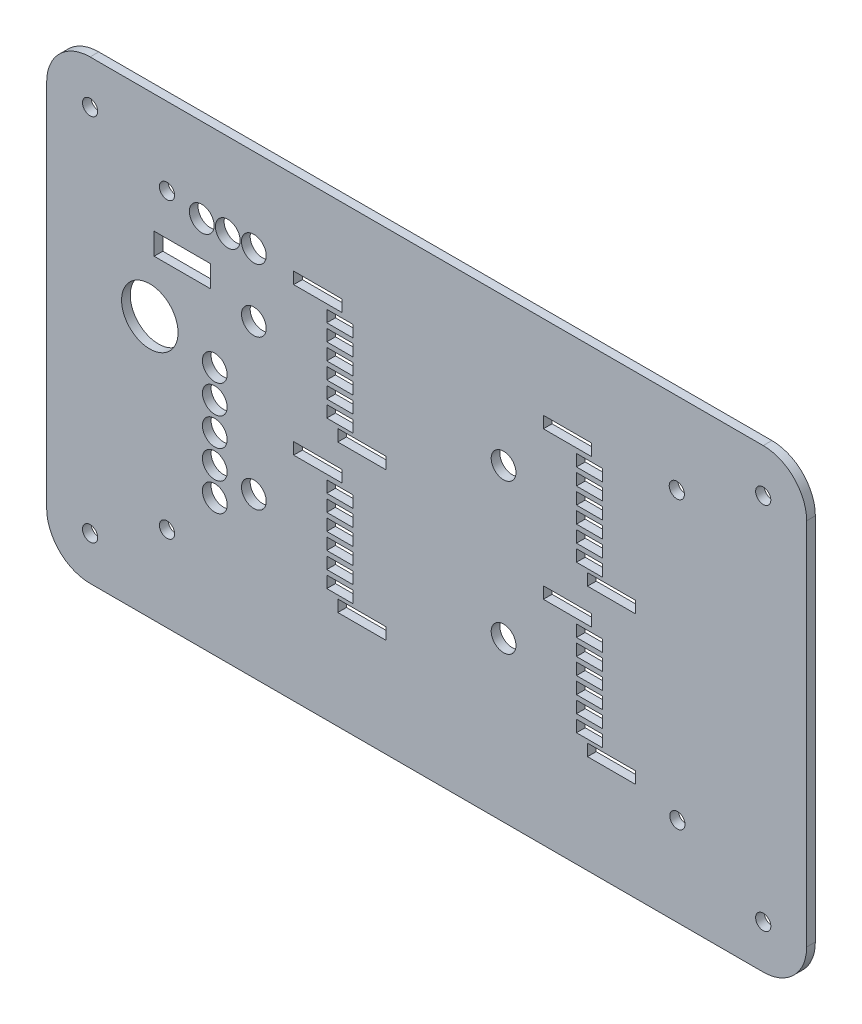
from build123d import *

# Parameters (mm, degrees)
ESQUISSE1_R      = 2.85
ESQUISSE1_R_2    = 6.5
ESQUISSE1_R_3    = 1.75
ESQUISSE1_W      = 11.08
ESQUISSE1_H      = 2.7
ESQUISSE1_W_2    = 6
ESQUISSE1_W_3    = 13
ESQUISSE1_H_2    = 5
EXTRUSION1_DEPTH = 2


with BuildPart() as part:
    # Esquisse1 → Extrusion1 (new body)
    with BuildSketch(Plane.XY):
        with BuildLine():
            Line((-78.68, 51.42), (76.32, 51.42))
            ThreePointArc((76.32, 51.42), (83.391067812, 48.491067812), (86.32, 41.42))
            Line((86.32, 41.42), (86.32, -43.58))
            ThreePointArc((86.32, -43.58), (83.391067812, -50.651067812), (76.32, -53.58))
            Line((76.32, -53.58), (-78.68, -53.58))
            ThreePointArc((-78.68, -53.58), (-85.751067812, -50.651067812), (-88.68, -43.58))
            Line((-88.68, -43.58), (-88.68, 41.42))
            ThreePointArc((-88.68, 41.42), (-85.751067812, 48.491067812), (-78.68, 51.42))
        make_face()
        with Locations((16.53, 17.55)):
            Circle(ESQUISSE1_R, mode=Mode.SUBTRACT)
        with Locations((-40.97, 17.55)):
            Circle(ESQUISSE1_R, mode=Mode.SUBTRACT)
        with Locations((16.53, -16.9299)):
            Circle(ESQUISSE1_R, mode=Mode.SUBTRACT)
        with Locations((-40.97, -16.9299)):
            Circle(ESQUISSE1_R, mode=Mode.SUBTRACT)
        with Locations((-52.97, 32.05)):
            Circle(ESQUISSE1_R, mode=Mode.SUBTRACT)
        with Locations((-46.97, 32.05)):
            Circle(ESQUISSE1_R, mode=Mode.SUBTRACT)
        with Locations((-40.97, 32.05)):
            Circle(ESQUISSE1_R, mode=Mode.SUBTRACT)
        with Locations((-49.97, 3.8401)):
            Circle(ESQUISSE1_R, mode=Mode.SUBTRACT)
        with Locations((-49.97, -2.6599)):
            Circle(ESQUISSE1_R, mode=Mode.SUBTRACT)
        with Locations((-49.97, -9.1599)):
            Circle(ESQUISSE1_R, mode=Mode.SUBTRACT)
        with Locations((-49.97, -15.6599)):
            Circle(ESQUISSE1_R, mode=Mode.SUBTRACT)
        with Locations((-49.97, -22.1599)):
            Circle(ESQUISSE1_R, mode=Mode.SUBTRACT)
        with Locations((-64.93, 6.55)):
            Circle(ESQUISSE1_R_2, mode=Mode.SUBTRACT)
        with Locations((-60.97, 33.55)):
            Circle(ESQUISSE1_R_3, mode=Mode.SUBTRACT)
        with Locations((-60.97, -33.98)):
            Circle(ESQUISSE1_R_3, mode=Mode.SUBTRACT)
        with Locations((56.56, -33.17)):
            Circle(ESQUISSE1_R_3, mode=Mode.SUBTRACT)
        with Locations((56.42, 32.6)):
            Circle(ESQUISSE1_R_3, mode=Mode.SUBTRACT)
        with Locations((76.32, 41.42)):
            Circle(ESQUISSE1_R_3, mode=Mode.SUBTRACT)
        with Locations((-78.68, 41.42)):
            Circle(ESQUISSE1_R_3, mode=Mode.SUBTRACT)
        with Locations((-78.68, -43.58)):
            Circle(ESQUISSE1_R_3, mode=Mode.SUBTRACT)
        with Locations((76.32, -43.58)):
            Circle(ESQUISSE1_R_3, mode=Mode.SUBTRACT)
        with Locations((-16.1, 4.5)):
            Rectangle(ESQUISSE1_W, ESQUISSE1_H, mode=Mode.SUBTRACT)
        with Locations((-26.26, 30.8)):
            Rectangle(ESQUISSE1_W, ESQUISSE1_H, mode=Mode.SUBTRACT)
        with Locations((41.4, -29.5)):
            Rectangle(ESQUISSE1_W, ESQUISSE1_H, mode=Mode.SUBTRACT)
        with Locations((41.4, 4.5)):
            Rectangle(ESQUISSE1_W, ESQUISSE1_H, mode=Mode.SUBTRACT)
        with Locations((-21.18, 8)):
            Rectangle(ESQUISSE1_W_2, ESQUISSE1_H, mode=Mode.SUBTRACT)
        with Locations((-21.18, 11.8)):
            Rectangle(ESQUISSE1_W_2, ESQUISSE1_H, mode=Mode.SUBTRACT)
        with Locations((-21.18, 15.6)):
            Rectangle(ESQUISSE1_W_2, ESQUISSE1_H, mode=Mode.SUBTRACT)
        with Locations((-21.18, 19.4)):
            Rectangle(ESQUISSE1_W_2, ESQUISSE1_H, mode=Mode.SUBTRACT)
        with Locations((-21.18, 23.2)):
            Rectangle(ESQUISSE1_W_2, ESQUISSE1_H, mode=Mode.SUBTRACT)
        with Locations((-21.18, 27)):
            Rectangle(ESQUISSE1_W_2, ESQUISSE1_H, mode=Mode.SUBTRACT)
        with Locations((36.32, 8)):
            Rectangle(ESQUISSE1_W_2, ESQUISSE1_H, mode=Mode.SUBTRACT)
        with Locations((36.32, 11.8)):
            Rectangle(ESQUISSE1_W_2, ESQUISSE1_H, mode=Mode.SUBTRACT)
        with Locations((36.32, 15.6)):
            Rectangle(ESQUISSE1_W_2, ESQUISSE1_H, mode=Mode.SUBTRACT)
        with Locations((36.32, 19.4)):
            Rectangle(ESQUISSE1_W_2, ESQUISSE1_H, mode=Mode.SUBTRACT)
        with Locations((36.32, 23.2)):
            Rectangle(ESQUISSE1_W_2, ESQUISSE1_H, mode=Mode.SUBTRACT)
        with Locations((36.32, 27)):
            Rectangle(ESQUISSE1_W_2, ESQUISSE1_H, mode=Mode.SUBTRACT)
        with Locations((31.24, 30.8)):
            Rectangle(ESQUISSE1_W, ESQUISSE1_H, mode=Mode.SUBTRACT)
        with Locations((-57.43, 21.55)):
            Rectangle(ESQUISSE1_W_3, ESQUISSE1_H_2, mode=Mode.SUBTRACT)
        with Locations((-16.1, -29.5)):
            Rectangle(ESQUISSE1_W, ESQUISSE1_H, mode=Mode.SUBTRACT)
        with Locations((-21.18, -26)):
            Rectangle(ESQUISSE1_W_2, ESQUISSE1_H, mode=Mode.SUBTRACT)
        with Locations((-21.18, -22.2)):
            Rectangle(ESQUISSE1_W_2, ESQUISSE1_H, mode=Mode.SUBTRACT)
        with Locations((-21.18, -18.4)):
            Rectangle(ESQUISSE1_W_2, ESQUISSE1_H, mode=Mode.SUBTRACT)
        with Locations((-21.18, -14.6)):
            Rectangle(ESQUISSE1_W_2, ESQUISSE1_H, mode=Mode.SUBTRACT)
        with Locations((-21.18, -10.8)):
            Rectangle(ESQUISSE1_W_2, ESQUISSE1_H, mode=Mode.SUBTRACT)
        with Locations((-21.18, -7)):
            Rectangle(ESQUISSE1_W_2, ESQUISSE1_H, mode=Mode.SUBTRACT)
        with Locations((36.32, -26)):
            Rectangle(ESQUISSE1_W_2, ESQUISSE1_H, mode=Mode.SUBTRACT)
        with Locations((-26.26, -3.2)):
            Rectangle(ESQUISSE1_W, ESQUISSE1_H, mode=Mode.SUBTRACT)
        with Locations((36.32, -22.2)):
            Rectangle(ESQUISSE1_W_2, ESQUISSE1_H, mode=Mode.SUBTRACT)
        with Locations((36.32, -18.4)):
            Rectangle(ESQUISSE1_W_2, ESQUISSE1_H, mode=Mode.SUBTRACT)
        with Locations((36.32, -14.6)):
            Rectangle(ESQUISSE1_W_2, ESQUISSE1_H, mode=Mode.SUBTRACT)
        with Locations((36.32, -10.8)):
            Rectangle(ESQUISSE1_W_2, ESQUISSE1_H, mode=Mode.SUBTRACT)
        with Locations((36.32, -7)):
            Rectangle(ESQUISSE1_W_2, ESQUISSE1_H, mode=Mode.SUBTRACT)
        with Locations((31.24, -3.2)):
            Rectangle(ESQUISSE1_W, ESQUISSE1_H, mode=Mode.SUBTRACT)
    extrude(amount=EXTRUSION1_DEPTH)


solid = part.part
